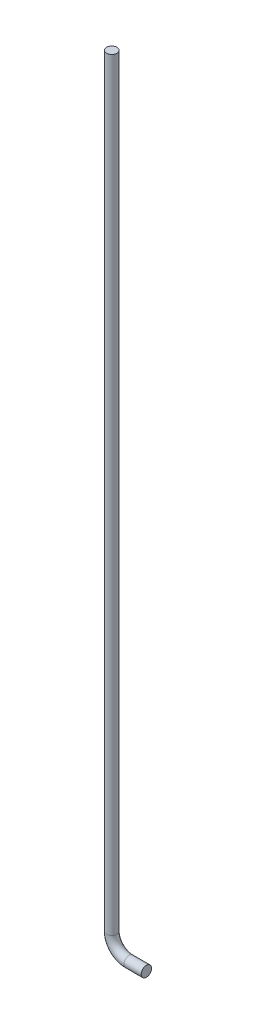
ISO-10303-21;
HEADER;
FILE_DESCRIPTION(('STEP AP214'),'2;1');
FILE_NAME('part.step','',(''),(''),'','','');
FILE_SCHEMA(('AUTOMOTIVE_DESIGN { 1 0 10303 214 1 1 1 1 }'));
ENDSEC;
DATA;
#1=APPLICATION_CONTEXT('core data for automotive mechanical design processes');
#2=APPLICATION_PROTOCOL_DEFINITION('international standard','automotive_design',2000,#1);
#3=PRODUCT_CONTEXT('',#1,'mechanical');
#4=PRODUCT('Part','Part','',(#3));
#5=PRODUCT_RELATED_PRODUCT_CATEGORY('part','',(#4));
#6=PRODUCT_DEFINITION_FORMATION('','',#4);
#7=PRODUCT_DEFINITION_CONTEXT('part definition',#1,'design');
#8=PRODUCT_DEFINITION('design','',#6,#7);
#9=PRODUCT_DEFINITION_SHAPE('','',#8);
#10=(LENGTH_UNIT() NAMED_UNIT(*) SI_UNIT(.MILLI.,.METRE.));
#11=(NAMED_UNIT(*) PLANE_ANGLE_UNIT() SI_UNIT($,.RADIAN.));
#12=(NAMED_UNIT(*) SI_UNIT($,.STERADIAN.) SOLID_ANGLE_UNIT());
#13=UNCERTAINTY_MEASURE_WITH_UNIT(LENGTH_MEASURE(1.E-05),#10,'distance_accuracy_value','');
#14=(GEOMETRIC_REPRESENTATION_CONTEXT(3) GLOBAL_UNCERTAINTY_ASSIGNED_CONTEXT((#13)) GLOBAL_UNIT_ASSIGNED_CONTEXT((#10,
#11,#12)) REPRESENTATION_CONTEXT('',''));
#15=CARTESIAN_POINT('',(0.,0.,0.));
#16=DIRECTION('',(0.,0.,1.));
#17=DIRECTION('',(1.,0.,0.));
#18=AXIS2_PLACEMENT_3D('',#15,#16,#17);
#19=CARTESIAN_POINT('',(0.,0.,0.));
#20=DIRECTION('',(1.,0.,0.));
#21=DIRECTION('',(0.,0.,-1.));
#22=AXIS2_PLACEMENT_3D('',#19,#20,#21);
#23=PLANE('',#22);
#24=CARTESIAN_POINT('',(0.,0.,0.));
#25=DIRECTION('',(1.,0.,0.));
#26=DIRECTION('',(0.,0.,-1.));
#27=AXIS2_PLACEMENT_3D('',#24,#25,#26);
#28=CIRCLE('',#27,0.6);
#29=CARTESIAN_POINT('',(0.,0.,-0.6));
#30=VERTEX_POINT('',#29);
#31=EDGE_CURVE('E18',#30,#30,#28,.F.);
#32=ORIENTED_EDGE('',*,*,#31,.F.);
#33=EDGE_LOOP('',(#32));
#34=FACE_BOUND('',#33,.T.);
#35=ADVANCED_FACE('F15',(#34),#23,.T.);
#36=CARTESIAN_POINT('',(-2.,0.,0.));
#37=DIRECTION('',(1.,0.,0.));
#38=DIRECTION('',(0.,0.,-1.));
#39=AXIS2_PLACEMENT_3D('',#36,#37,#38);
#40=CYLINDRICAL_SURFACE('',#39,0.6);
#41=CARTESIAN_POINT('',(-2.,0.,0.));
#42=DIRECTION('',(-1.,0.,0.));
#43=DIRECTION('',(0.,-1.,0.));
#44=AXIS2_PLACEMENT_3D('',#41,#42,#43);
#45=CIRCLE('',#44,0.6);
#46=CARTESIAN_POINT('',(-2.,-0.599999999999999,0.));
#47=VERTEX_POINT('',#46);
#48=EDGE_CURVE('E26',#47,#47,#45,.T.);
#49=ORIENTED_EDGE('',*,*,#48,.F.);
#50=EDGE_LOOP('',(#49));
#51=FACE_BOUND('',#50,.T.);
#52=ORIENTED_EDGE('',*,*,#31,.T.);
#53=EDGE_LOOP('',(#52));
#54=FACE_BOUND('',#53,.T.);
#55=ADVANCED_FACE('F37',(#51,#54),#40,.T.);
#56=CARTESIAN_POINT('',(-2.,2.,0.));
#57=DIRECTION('',(0.,0.,-1.));
#58=DIRECTION('',(-1.,0.,0.));
#59=AXIS2_PLACEMENT_3D('',#56,#57,#58);
#60=TOROIDAL_SURFACE('',#59,2.,0.6);
#61=CARTESIAN_POINT('',(-4.,2.,0.));
#62=DIRECTION('',(0.,1.,0.));
#63=DIRECTION('',(0.,0.,1.));
#64=AXIS2_PLACEMENT_3D('',#61,#62,#63);
#65=CIRCLE('',#64,0.6);
#66=CARTESIAN_POINT('',(-4.,2.,0.6));
#67=VERTEX_POINT('',#66);
#68=EDGE_CURVE('E22',#67,#67,#65,.T.);
#69=ORIENTED_EDGE('',*,*,#68,.F.);
#70=EDGE_LOOP('',(#69));
#71=FACE_BOUND('',#70,.T.);
#72=ORIENTED_EDGE('',*,*,#48,.T.);
#73=EDGE_LOOP('',(#72));
#74=FACE_BOUND('',#73,.T.);
#75=ADVANCED_FACE('F33',(#71,#74),#60,.T.);
#76=CARTESIAN_POINT('',(-4.,90.,0.));
#77=DIRECTION('',(0.,-1.,0.));
#78=DIRECTION('',(1.,0.,0.));
#79=AXIS2_PLACEMENT_3D('',#76,#77,#78);
#80=PLANE('',#79);
#81=CARTESIAN_POINT('',(-4.,90.,0.));
#82=DIRECTION('',(0.,1.,0.));
#83=DIRECTION('',(0.,0.,1.));
#84=AXIS2_PLACEMENT_3D('',#81,#82,#83);
#85=CIRCLE('',#84,0.6);
#86=CARTESIAN_POINT('',(-4.,90.,0.6));
#87=VERTEX_POINT('',#86);
#88=EDGE_CURVE('E10',#87,#87,#85,.F.);
#89=ORIENTED_EDGE('',*,*,#88,.F.);
#90=EDGE_LOOP('',(#89));
#91=FACE_BOUND('',#90,.T.);
#92=ADVANCED_FACE('F36',(#91),#80,.F.);
#93=CARTESIAN_POINT('',(-4.,2.,0.));
#94=DIRECTION('',(0.,1.,0.));
#95=DIRECTION('',(0.,0.,1.));
#96=AXIS2_PLACEMENT_3D('',#93,#94,#95);
#97=CYLINDRICAL_SURFACE('',#96,0.6);
#98=ORIENTED_EDGE('',*,*,#88,.T.);
#99=EDGE_LOOP('',(#98));
#100=FACE_BOUND('',#99,.T.);
#101=ORIENTED_EDGE('',*,*,#68,.T.);
#102=EDGE_LOOP('',(#101));
#103=FACE_BOUND('',#102,.T.);
#104=ADVANCED_FACE('F49',(#100,#103),#97,.T.);
#105=CLOSED_SHELL('',(#35,#55,#75,#92,#104));
#106=MANIFOLD_SOLID_BREP('B1',#105);
#107=ADVANCED_BREP_SHAPE_REPRESENTATION('',(#18,#106),#14);
#108=SHAPE_DEFINITION_REPRESENTATION(#9,#107);
ENDSEC;
END-ISO-10303-21;
